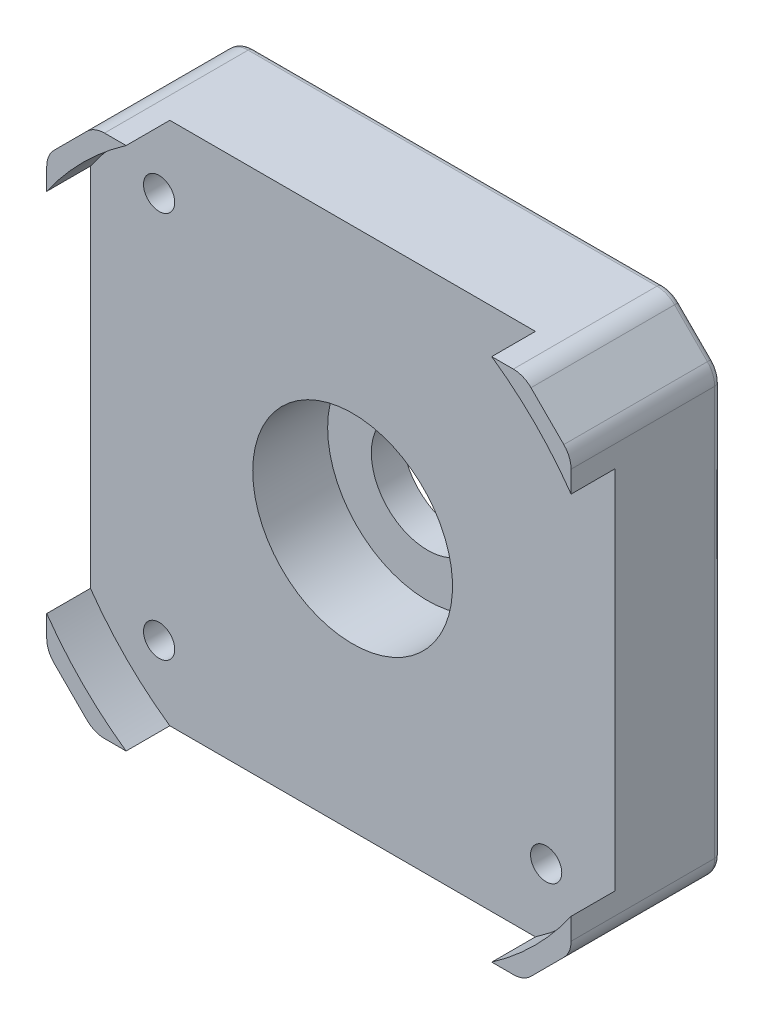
from build123d import *

# Parameters (mm, degrees)
BOSS_EXTRUDE1_DEPTH            = 8.5
BOSS_EXTRUDE2_DEPTH            = 3.5
BOSS_EXTRUDE3_DEPTH            = 3.5
BOSS_EXTRUDE4_DEPTH            = 3.5
BOSS_EXTRUDE5_DEPTH            = 3.5
F_2_5_2_5_DIAMETER_HOLE1_D     = 2.5
F_2_5_2_5_DIAMETER_HOLE1_DEPTH = 12.000025
FILLET1_R                      = 2
CHAMFER1_SIZE                  = 2.5
FILLET2_R                      = 0.5


with BuildPart() as part:
    # Sketch1 → Boss-Extrude1 (new body)
    with BuildSketch(Plane.XY.offset(7.7)):
        Polygon((-27.595502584, 83.617151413), (6.804497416, 83.617151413), (10.604497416, 87.417151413), (10.604497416, 121.817151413), (6.804497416, 125.617151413), (-27.595502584, 125.617151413), (-31.395502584, 121.817151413), (-31.395502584, 87.417151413), align=None)
    extrude(amount=-BOSS_EXTRUDE1_DEPTH)

    # Sketch2 → Boss-Extrude2 (add)
    with BuildSketch(Plane.XY.offset(7.7)):
        with BuildLine():
            Line((-27.595502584, 83.617151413), (-31.395502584, 87.417151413))
            Line((-31.395502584, 87.417151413), (-31.395502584, 89.976113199))
            ThreePointArc((-31.395502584, 89.976113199), (-28.497436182, 86.515217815), (-25.036540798, 83.617151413))
            Line((-25.036540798, 83.617151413), (-27.595502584, 83.617151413))
        make_face()
    extrude(amount=BOSS_EXTRUDE2_DEPTH)

    # Sketch3 → Boss-Extrude3 (add)
    with BuildSketch(Plane.XY.offset(7.7)):
        with BuildLine():
            Line((10.604497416, 87.417151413), (6.804497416, 83.617151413))
            Line((6.804497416, 83.617151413), (4.245535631, 83.617151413))
            ThreePointArc((4.245535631, 83.617151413), (7.706431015, 86.515217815), (10.604497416, 89.976113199))
            Line((10.604497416, 89.976113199), (10.604497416, 87.417151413))
        make_face()
    extrude(amount=BOSS_EXTRUDE3_DEPTH)

    # Sketch4 → Boss-Extrude4 (add)
    with BuildSketch(Plane.XY.offset(7.7)):
        with BuildLine():
            Line((-31.395502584, 121.817151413), (-27.595502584, 125.617151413))
            Line((-27.595502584, 125.617151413), (-25.036540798, 125.617151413))
            ThreePointArc((-25.036540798, 125.617151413), (-28.497436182, 122.719085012), (-31.395502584, 119.258189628))
            Line((-31.395502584, 119.258189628), (-31.395502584, 121.817151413))
        make_face()
    extrude(amount=BOSS_EXTRUDE4_DEPTH)

    # Sketch5 → Boss-Extrude5 (add)
    with BuildSketch(Plane.XY.offset(7.7)):
        with BuildLine():
            Line((6.804497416, 125.617151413), (10.604497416, 121.817151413))
            Line((10.604497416, 121.817151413), (10.604497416, 119.258189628))
            ThreePointArc((10.604497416, 119.258189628), (7.706431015, 122.719085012), (4.245535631, 125.617151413))
            Line((4.245535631, 125.617151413), (6.804497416, 125.617151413))
        make_face()
    extrude(amount=BOSS_EXTRUDE5_DEPTH)

    # Sketch6 → Cut-Revolve1 (revolve, cut)
    with BuildSketch(Plane.XZ.offset(-104.617151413), mode=Mode.PRIVATE) as cut_revolve1_sk:
        Polygon((-2.395502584, 7.7), (-10.395502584, 7.7), (-10.395502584, -0.8), (-5.895502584, -0.8), (-5.895502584, 1.7), (-2.395502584, 1.7), align=None)
    revolve(cut_revolve1_sk.sketch.rotate(Axis((-10.395502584, 104.617151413, 7.7), (0, 0, -1)), 180), axis=Axis((-10.395502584, 104.617151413, 7.7), (0, 0, -1)), mode=Mode.SUBTRACT)

    # 2.5 _2.5_ Diameter Hole1
    with Locations(Plane(origin=(0, 0, -0.8), x_dir=(-1, 0, 0), z_dir=(0, 0, -1))):
        with Locations((25.895502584, 89.117151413), (-5.104497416, 89.117151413), (-5.104497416, 120.117151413), (25.895502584, 120.117151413)):
            Hole(F_2_5_2_5_DIAMETER_HOLE1_D / 2, depth=F_2_5_2_5_DIAMETER_HOLE1_DEPTH)

    # Fillet1
    fillet1_edges = [part.edges().sort_by_distance(p)[0] for p in [
        (-31.395502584, 87.417151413, 5.2),
        (-31.395502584, 121.817151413, 5.2),
        (-27.595502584, 125.617151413, 5.2),
        (6.804497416, 125.617151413, 5.2),
        (10.604497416, 121.817151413, 5.2),
        (10.604497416, 87.417151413, 5.2),
        (6.804497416, 83.617151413, 5.2),
        (-27.595502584, 83.617151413, 5.2),
    ]]
    fillet(fillet1_edges, radius=FILLET1_R)

    # Chamfer1
    chamfer1_edges = [part.edges().sort_by_distance(p)[0] for p in [
        (-27.145502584, 89.117151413, -0.8),
        (-27.145502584, 120.117151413, -0.8),
        (3.854497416, 120.117151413, -0.8),
        (3.854497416, 89.117151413, -0.8),
    ]]
    chamfer(chamfer1_edges, length=CHAMFER1_SIZE)

    # Fillet2
    fillet2_edges = [part.edges().sort_by_distance(p)[0] for p in [
        (8.704497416, 123.717151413, -0.8),
        (-10.395502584, 125.617151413, -0.8),
        (-29.495502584, 85.517151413, -0.8),
        (-31.395502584, 104.617151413, -0.8),
        (-29.495502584, 123.717151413, -0.8),
        (10.604497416, 104.617151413, -0.8),
        (8.704497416, 85.517151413, -0.8),
        (-10.395502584, 83.617151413, -0.8),
        (10.452256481, 121.754091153, -0.8),
        (-27.532442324, 83.769392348, -0.8),
        (6.741437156, 83.769392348, -0.8),
        (-27.532442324, 125.464910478, -0.8),
        (10.452256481, 87.480211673, -0.8),
        (-31.243261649, 87.480211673, -0.8),
        (-31.243261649, 121.754091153, -0.8),
        (6.741437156, 125.464910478, -0.8),
    ]]
    fillet(fillet2_edges, radius=FILLET2_R)


solid = part.part
